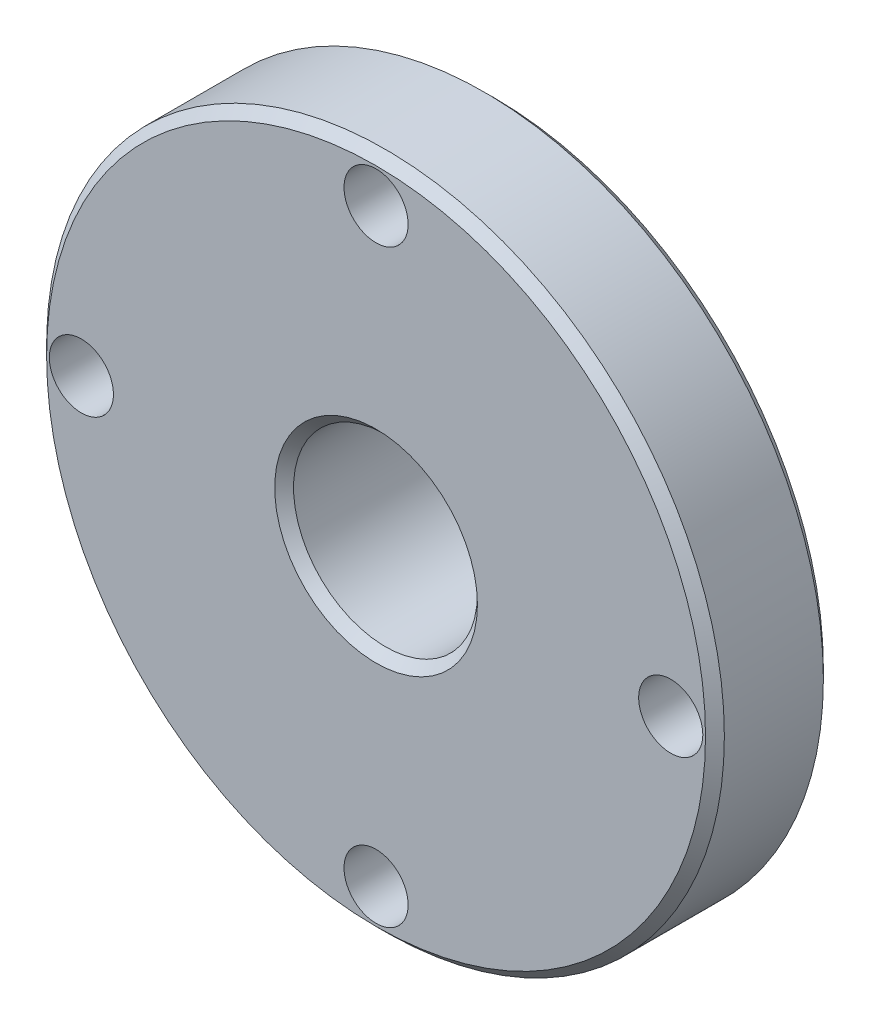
ISO-10303-21;
HEADER;
FILE_DESCRIPTION(('STEP AP214'),'2;1');
FILE_NAME('part.step','',(''),(''),'','','');
FILE_SCHEMA(('AUTOMOTIVE_DESIGN { 1 0 10303 214 1 1 1 1 }'));
ENDSEC;
DATA;
#1=APPLICATION_CONTEXT('core data for automotive mechanical design processes');
#2=APPLICATION_PROTOCOL_DEFINITION('international standard','automotive_design',2000,#1);
#3=PRODUCT_CONTEXT('',#1,'mechanical');
#4=PRODUCT('Part','Part','',(#3));
#5=PRODUCT_RELATED_PRODUCT_CATEGORY('part','',(#4));
#6=PRODUCT_DEFINITION_FORMATION('','',#4);
#7=PRODUCT_DEFINITION_CONTEXT('part definition',#1,'design');
#8=PRODUCT_DEFINITION('design','',#6,#7);
#9=PRODUCT_DEFINITION_SHAPE('','',#8);
#10=(LENGTH_UNIT() NAMED_UNIT(*) SI_UNIT(.MILLI.,.METRE.));
#11=(NAMED_UNIT(*) PLANE_ANGLE_UNIT() SI_UNIT($,.RADIAN.));
#12=(NAMED_UNIT(*) SI_UNIT($,.STERADIAN.) SOLID_ANGLE_UNIT());
#13=UNCERTAINTY_MEASURE_WITH_UNIT(LENGTH_MEASURE(1.E-05),#10,'distance_accuracy_value','');
#14=(GEOMETRIC_REPRESENTATION_CONTEXT(3) GLOBAL_UNCERTAINTY_ASSIGNED_CONTEXT((#13)) GLOBAL_UNIT_ASSIGNED_CONTEXT((#10,
#11,#12)) REPRESENTATION_CONTEXT('',''));
#15=CARTESIAN_POINT('',(0.,0.,0.));
#16=DIRECTION('',(0.,0.,1.));
#17=DIRECTION('',(1.,0.,0.));
#18=AXIS2_PLACEMENT_3D('',#15,#16,#17);
#19=CARTESIAN_POINT('',(0.,0.,0.));
#20=DIRECTION('',(0.,0.,1.));
#21=DIRECTION('',(1.,0.,0.));
#22=AXIS2_PLACEMENT_3D('',#19,#20,#21);
#23=PLANE('',#22);
#24=CARTESIAN_POINT('',(0.,0.,0.));
#25=DIRECTION('',(0.,0.,1.));
#26=DIRECTION('',(1.,0.,0.));
#27=AXIS2_PLACEMENT_3D('',#24,#25,#26);
#28=CIRCLE('',#27,17.74825);
#29=CARTESIAN_POINT('',(17.74825,0.,0.));
#30=VERTEX_POINT('',#29);
#31=EDGE_CURVE('E61',#30,#30,#28,.F.);
#32=ORIENTED_EDGE('',*,*,#31,.T.);
#33=EDGE_LOOP('',(#32));
#34=FACE_BOUND('',#33,.T.);
#35=CARTESIAN_POINT('',(0.,15.875,0.));
#36=DIRECTION('',(0.,0.,1.));
#37=DIRECTION('',(1.,0.,0.));
#38=AXIS2_PLACEMENT_3D('',#35,#36,#37);
#39=CIRCLE('',#38,1.7272);
#40=CARTESIAN_POINT('',(1.7272,15.875,0.));
#41=VERTEX_POINT('',#40);
#42=EDGE_CURVE('E73',#41,#41,#39,.T.);
#43=ORIENTED_EDGE('',*,*,#42,.T.);
#44=EDGE_LOOP('',(#43));
#45=FACE_BOUND('',#44,.T.);
#46=CARTESIAN_POINT('',(-15.875,0.,0.));
#47=DIRECTION('',(0.,0.,1.));
#48=DIRECTION('',(1.,0.,0.));
#49=AXIS2_PLACEMENT_3D('',#46,#47,#48);
#50=CIRCLE('',#49,1.7272);
#51=CARTESIAN_POINT('',(-14.1478,0.,0.));
#52=VERTEX_POINT('',#51);
#53=EDGE_CURVE('E79',#52,#52,#50,.T.);
#54=ORIENTED_EDGE('',*,*,#53,.T.);
#55=EDGE_LOOP('',(#54));
#56=FACE_BOUND('',#55,.T.);
#57=CARTESIAN_POINT('',(0.,-15.875,0.));
#58=DIRECTION('',(0.,0.,1.));
#59=DIRECTION('',(1.,0.,0.));
#60=AXIS2_PLACEMENT_3D('',#57,#58,#59);
#61=CIRCLE('',#60,1.7272);
#62=CARTESIAN_POINT('',(1.7272,-15.875,0.));
#63=VERTEX_POINT('',#62);
#64=EDGE_CURVE('E85',#63,#63,#61,.T.);
#65=ORIENTED_EDGE('',*,*,#64,.T.);
#66=EDGE_LOOP('',(#65));
#67=FACE_BOUND('',#66,.T.);
#68=CARTESIAN_POINT('',(15.875,0.,0.));
#69=DIRECTION('',(0.,0.,1.));
#70=DIRECTION('',(1.,0.,0.));
#71=AXIS2_PLACEMENT_3D('',#68,#69,#70);
#72=CIRCLE('',#71,1.7272);
#73=CARTESIAN_POINT('',(17.6022,0.,0.));
#74=VERTEX_POINT('',#73);
#75=EDGE_CURVE('E91',#74,#74,#72,.T.);
#76=ORIENTED_EDGE('',*,*,#75,.T.);
#77=EDGE_LOOP('',(#76));
#78=FACE_BOUND('',#77,.T.);
#79=CARTESIAN_POINT('',(0.,0.,0.));
#80=DIRECTION('',(0.,0.,1.));
#81=DIRECTION('',(1.,0.,0.));
#82=AXIS2_PLACEMENT_3D('',#79,#80,#81);
#83=CIRCLE('',#82,9.4615);
#84=CARTESIAN_POINT('',(9.4615,0.,0.));
#85=VERTEX_POINT('',#84);
#86=EDGE_CURVE('E70',#85,#85,#83,.F.);
#87=ORIENTED_EDGE('',*,*,#86,.F.);
#88=EDGE_LOOP('',(#87));
#89=FACE_BOUND('',#88,.T.);
#90=ADVANCED_FACE('F32',(#34,#45,#56,#67,#78,#89),#23,.F.);
#91=CARTESIAN_POINT('',(0.,0.,6.35));
#92=DIRECTION('',(0.,0.,-1.));
#93=DIRECTION('',(-1.,0.,0.));
#94=AXIS2_PLACEMENT_3D('',#91,#92,#93);
#95=CYLINDRICAL_SURFACE('',#94,18.25625);
#96=CARTESIAN_POINT('',(0.,0.,0.508000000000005));
#97=DIRECTION('',(0.,0.,1.));
#98=DIRECTION('',(1.,0.,0.));
#99=AXIS2_PLACEMENT_3D('',#96,#97,#98);
#100=CIRCLE('',#99,18.25625);
#101=CARTESIAN_POINT('',(18.25625,0.,0.508000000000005));
#102=VERTEX_POINT('',#101);
#103=EDGE_CURVE('E64',#102,#102,#100,.T.);
#104=ORIENTED_EDGE('',*,*,#103,.T.);
#105=EDGE_LOOP('',(#104));
#106=FACE_BOUND('',#105,.T.);
#107=CARTESIAN_POINT('',(0.,0.,5.842));
#108=DIRECTION('',(0.,0.,1.));
#109=DIRECTION('',(1.,0.,0.));
#110=AXIS2_PLACEMENT_3D('',#107,#108,#109);
#111=CIRCLE('',#110,18.25625);
#112=CARTESIAN_POINT('',(18.25625,0.,5.842));
#113=VERTEX_POINT('',#112);
#114=EDGE_CURVE('E67',#113,#113,#111,.F.);
#115=ORIENTED_EDGE('',*,*,#114,.T.);
#116=EDGE_LOOP('',(#115));
#117=FACE_BOUND('',#116,.T.);
#118=ADVANCED_FACE('F34',(#106,#117),#95,.T.);
#119=CARTESIAN_POINT('',(0.,0.,6.35));
#120=DIRECTION('',(0.,0.,1.));
#121=DIRECTION('',(1.,0.,0.));
#122=AXIS2_PLACEMENT_3D('',#119,#120,#121);
#123=PLANE('',#122);
#124=CARTESIAN_POINT('',(0.,0.,6.35));
#125=DIRECTION('',(0.,0.,1.));
#126=DIRECTION('',(1.,0.,0.));
#127=AXIS2_PLACEMENT_3D('',#124,#125,#126);
#128=CIRCLE('',#127,17.74825);
#129=CARTESIAN_POINT('',(17.74825,0.,6.35));
#130=VERTEX_POINT('',#129);
#131=EDGE_CURVE('E55',#130,#130,#128,.T.);
#132=ORIENTED_EDGE('',*,*,#131,.T.);
#133=EDGE_LOOP('',(#132));
#134=FACE_BOUND('',#133,.T.);
#135=CARTESIAN_POINT('',(0.,0.,6.35));
#136=DIRECTION('',(0.,0.,1.));
#137=DIRECTION('',(1.,0.,0.));
#138=AXIS2_PLACEMENT_3D('',#135,#136,#137);
#139=CIRCLE('',#138,5.461);
#140=CARTESIAN_POINT('',(5.461,0.,6.35));
#141=VERTEX_POINT('',#140);
#142=EDGE_CURVE('E58',#141,#141,#139,.F.);
#143=ORIENTED_EDGE('',*,*,#142,.T.);
#144=EDGE_LOOP('',(#143));
#145=FACE_BOUND('',#144,.T.);
#146=CARTESIAN_POINT('',(15.875,0.,6.35));
#147=DIRECTION('',(0.,0.,1.));
#148=DIRECTION('',(1.,0.,0.));
#149=AXIS2_PLACEMENT_3D('',#146,#147,#148);
#150=CIRCLE('',#149,1.7272);
#151=CARTESIAN_POINT('',(17.6022,0.,6.35));
#152=VERTEX_POINT('',#151);
#153=EDGE_CURVE('E94',#152,#152,#150,.T.);
#154=ORIENTED_EDGE('',*,*,#153,.F.);
#155=EDGE_LOOP('',(#154));
#156=FACE_BOUND('',#155,.T.);
#157=CARTESIAN_POINT('',(0.,-15.875,6.35));
#158=DIRECTION('',(0.,0.,1.));
#159=DIRECTION('',(1.,0.,0.));
#160=AXIS2_PLACEMENT_3D('',#157,#158,#159);
#161=CIRCLE('',#160,1.7272);
#162=CARTESIAN_POINT('',(1.7272,-15.875,6.35));
#163=VERTEX_POINT('',#162);
#164=EDGE_CURVE('E88',#163,#163,#161,.T.);
#165=ORIENTED_EDGE('',*,*,#164,.F.);
#166=EDGE_LOOP('',(#165));
#167=FACE_BOUND('',#166,.T.);
#168=CARTESIAN_POINT('',(-15.875,0.,6.35));
#169=DIRECTION('',(0.,0.,1.));
#170=DIRECTION('',(1.,0.,0.));
#171=AXIS2_PLACEMENT_3D('',#168,#169,#170);
#172=CIRCLE('',#171,1.7272);
#173=CARTESIAN_POINT('',(-14.1478,0.,6.35));
#174=VERTEX_POINT('',#173);
#175=EDGE_CURVE('E82',#174,#174,#172,.T.);
#176=ORIENTED_EDGE('',*,*,#175,.F.);
#177=EDGE_LOOP('',(#176));
#178=FACE_BOUND('',#177,.T.);
#179=CARTESIAN_POINT('',(0.,15.875,6.35));
#180=DIRECTION('',(0.,0.,1.));
#181=DIRECTION('',(1.,0.,0.));
#182=AXIS2_PLACEMENT_3D('',#179,#180,#181);
#183=CIRCLE('',#182,1.7272);
#184=CARTESIAN_POINT('',(1.7272,15.875,6.35));
#185=VERTEX_POINT('',#184);
#186=EDGE_CURVE('E76',#185,#185,#183,.T.);
#187=ORIENTED_EDGE('',*,*,#186,.F.);
#188=EDGE_LOOP('',(#187));
#189=FACE_BOUND('',#188,.T.);
#190=ADVANCED_FACE('F100',(#134,#145,#156,#167,#178,#189),#123,.T.);
#191=CARTESIAN_POINT('',(0.,15.875,0.));
#192=DIRECTION('',(0.,0.,1.));
#193=DIRECTION('',(1.,0.,0.));
#194=AXIS2_PLACEMENT_3D('',#191,#192,#193);
#195=CYLINDRICAL_SURFACE('',#194,1.7272);
#196=ORIENTED_EDGE('',*,*,#42,.F.);
#197=EDGE_LOOP('',(#196));
#198=FACE_BOUND('',#197,.T.);
#199=ORIENTED_EDGE('',*,*,#186,.T.);
#200=EDGE_LOOP('',(#199));
#201=FACE_BOUND('',#200,.T.);
#202=ADVANCED_FACE('F103',(#198,#201),#195,.F.);
#203=CARTESIAN_POINT('',(-15.875,0.,0.));
#204=DIRECTION('',(0.,0.,1.));
#205=DIRECTION('',(1.,0.,0.));
#206=AXIS2_PLACEMENT_3D('',#203,#204,#205);
#207=CYLINDRICAL_SURFACE('',#206,1.7272);
#208=ORIENTED_EDGE('',*,*,#53,.F.);
#209=EDGE_LOOP('',(#208));
#210=FACE_BOUND('',#209,.T.);
#211=ORIENTED_EDGE('',*,*,#175,.T.);
#212=EDGE_LOOP('',(#211));
#213=FACE_BOUND('',#212,.T.);
#214=ADVANCED_FACE('F112',(#210,#213),#207,.F.);
#215=CARTESIAN_POINT('',(0.,-15.875,0.));
#216=DIRECTION('',(0.,0.,1.));
#217=DIRECTION('',(1.,0.,0.));
#218=AXIS2_PLACEMENT_3D('',#215,#216,#217);
#219=CYLINDRICAL_SURFACE('',#218,1.7272);
#220=ORIENTED_EDGE('',*,*,#64,.F.);
#221=EDGE_LOOP('',(#220));
#222=FACE_BOUND('',#221,.T.);
#223=ORIENTED_EDGE('',*,*,#164,.T.);
#224=EDGE_LOOP('',(#223));
#225=FACE_BOUND('',#224,.T.);
#226=ADVANCED_FACE('F118',(#222,#225),#219,.F.);
#227=CARTESIAN_POINT('',(15.875,0.,0.));
#228=DIRECTION('',(0.,0.,1.));
#229=DIRECTION('',(1.,0.,0.));
#230=AXIS2_PLACEMENT_3D('',#227,#228,#229);
#231=CYLINDRICAL_SURFACE('',#230,1.7272);
#232=ORIENTED_EDGE('',*,*,#75,.F.);
#233=EDGE_LOOP('',(#232));
#234=FACE_BOUND('',#233,.T.);
#235=ORIENTED_EDGE('',*,*,#153,.T.);
#236=EDGE_LOOP('',(#235));
#237=FACE_BOUND('',#236,.T.);
#238=ADVANCED_FACE('F98',(#234,#237),#231,.F.);
#239=CARTESIAN_POINT('',(0.,0.,0.));
#240=DIRECTION('',(0.,0.,1.));
#241=DIRECTION('',(1.,0.,0.));
#242=AXIS2_PLACEMENT_3D('',#239,#240,#241);
#243=CYLINDRICAL_SURFACE('',#242,4.953);
#244=CARTESIAN_POINT('',(0.,0.,-1.524));
#245=DIRECTION('',(0.,0.,-1.));
#246=DIRECTION('',(-1.,0.,0.));
#247=AXIS2_PLACEMENT_3D('',#244,#245,#246);
#248=CIRCLE('',#247,4.953);
#249=CARTESIAN_POINT('',(-4.953,0.,-1.524));
#250=VERTEX_POINT('',#249);
#251=EDGE_CURVE('E47',#250,#250,#248,.T.);
#252=ORIENTED_EDGE('',*,*,#251,.T.);
#253=EDGE_LOOP('',(#252));
#254=FACE_BOUND('',#253,.T.);
#255=CARTESIAN_POINT('',(0.,0.,5.842));
#256=DIRECTION('',(0.,0.,1.));
#257=DIRECTION('',(1.,0.,0.));
#258=AXIS2_PLACEMENT_3D('',#255,#256,#257);
#259=CIRCLE('',#258,4.953);
#260=CARTESIAN_POINT('',(4.953,0.,5.842));
#261=VERTEX_POINT('',#260);
#262=EDGE_CURVE('E52',#261,#261,#259,.T.);
#263=ORIENTED_EDGE('',*,*,#262,.T.);
#264=EDGE_LOOP('',(#263));
#265=FACE_BOUND('',#264,.T.);
#266=ADVANCED_FACE('F152',(#254,#265),#243,.F.);
#267=CARTESIAN_POINT('',(0.,0.,-2.032));
#268=DIRECTION('',(0.,0.,-1.));
#269=DIRECTION('',(-1.,0.,0.));
#270=AXIS2_PLACEMENT_3D('',#267,#268,#269);
#271=PLANE('',#270);
#272=CARTESIAN_POINT('',(0.,0.,-2.032));
#273=DIRECTION('',(0.,0.,-1.));
#274=DIRECTION('',(-1.,0.,0.));
#275=AXIS2_PLACEMENT_3D('',#272,#273,#274);
#276=CIRCLE('',#275,5.461);
#277=CARTESIAN_POINT('',(-5.461,0.,-2.032));
#278=VERTEX_POINT('',#277);
#279=EDGE_CURVE('E39',#278,#278,#276,.F.);
#280=ORIENTED_EDGE('',*,*,#279,.T.);
#281=EDGE_LOOP('',(#280));
#282=FACE_BOUND('',#281,.T.);
#283=CARTESIAN_POINT('',(0.,0.,-2.032));
#284=DIRECTION('',(0.,0.,-1.));
#285=DIRECTION('',(-1.,0.,0.));
#286=AXIS2_PLACEMENT_3D('',#283,#284,#285);
#287=CIRCLE('',#286,8.9535);
#288=CARTESIAN_POINT('',(-8.9535,0.,-2.032));
#289=VERTEX_POINT('',#288);
#290=EDGE_CURVE('E43',#289,#289,#287,.T.);
#291=ORIENTED_EDGE('',*,*,#290,.T.);
#292=EDGE_LOOP('',(#291));
#293=FACE_BOUND('',#292,.T.);
#294=ADVANCED_FACE('F143',(#282,#293),#271,.T.);
#295=CARTESIAN_POINT('',(0.,0.,-2.032));
#296=DIRECTION('',(0.,0.,1.));
#297=DIRECTION('',(1.,0.,0.));
#298=AXIS2_PLACEMENT_3D('',#295,#296,#297);
#299=CYLINDRICAL_SURFACE('',#298,9.4615);
#300=CARTESIAN_POINT('',(0.,0.,-1.524));
#301=DIRECTION('',(0.,0.,-1.));
#302=DIRECTION('',(-1.,0.,0.));
#303=AXIS2_PLACEMENT_3D('',#300,#301,#302);
#304=CIRCLE('',#303,9.4615);
#305=CARTESIAN_POINT('',(-9.4615,0.,-1.524));
#306=VERTEX_POINT('',#305);
#307=EDGE_CURVE('E10',#306,#306,#304,.F.);
#308=ORIENTED_EDGE('',*,*,#307,.T.);
#309=EDGE_LOOP('',(#308));
#310=FACE_BOUND('',#309,.T.);
#311=ORIENTED_EDGE('',*,*,#86,.T.);
#312=EDGE_LOOP('',(#311));
#313=FACE_BOUND('',#312,.T.);
#314=ADVANCED_FACE('F140',(#310,#313),#299,.T.);
#315=CARTESIAN_POINT('',(0.,0.,0.508000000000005));
#316=DIRECTION('',(0.,0.,1.));
#317=DIRECTION('',(1.,0.,0.));
#318=AXIS2_PLACEMENT_3D('',#315,#316,#317);
#319=CONICAL_SURFACE('',#318,18.25625,0.785398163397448);
#320=ORIENTED_EDGE('',*,*,#31,.F.);
#321=EDGE_LOOP('',(#320));
#322=FACE_BOUND('',#321,.T.);
#323=ORIENTED_EDGE('',*,*,#103,.F.);
#324=EDGE_LOOP('',(#323));
#325=FACE_BOUND('',#324,.T.);
#326=ADVANCED_FACE('F142',(#322,#325),#319,.T.);
#327=CARTESIAN_POINT('',(0.,0.,6.35));
#328=DIRECTION('',(0.,0.,-1.));
#329=DIRECTION('',(-1.,0.,0.));
#330=AXIS2_PLACEMENT_3D('',#327,#328,#329);
#331=CONICAL_SURFACE('',#330,17.74825,0.785398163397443);
#332=ORIENTED_EDGE('',*,*,#114,.F.);
#333=EDGE_LOOP('',(#332));
#334=FACE_BOUND('',#333,.T.);
#335=ORIENTED_EDGE('',*,*,#131,.F.);
#336=EDGE_LOOP('',(#335));
#337=FACE_BOUND('',#336,.T.);
#338=ADVANCED_FACE('F149',(#334,#337),#331,.T.);
#339=CARTESIAN_POINT('',(0.,0.,-1.524));
#340=DIRECTION('',(0.,0.,-1.));
#341=DIRECTION('',(-1.,0.,0.));
#342=AXIS2_PLACEMENT_3D('',#339,#340,#341);
#343=CONICAL_SURFACE('',#342,4.953,0.785398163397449);
#344=ORIENTED_EDGE('',*,*,#279,.F.);
#345=EDGE_LOOP('',(#344));
#346=FACE_BOUND('',#345,.T.);
#347=ORIENTED_EDGE('',*,*,#251,.F.);
#348=EDGE_LOOP('',(#347));
#349=FACE_BOUND('',#348,.T.);
#350=ADVANCED_FACE('F200',(#346,#349),#343,.F.);
#351=CARTESIAN_POINT('',(0.,0.,-2.032));
#352=DIRECTION('',(0.,0.,1.));
#353=DIRECTION('',(1.,0.,0.));
#354=AXIS2_PLACEMENT_3D('',#351,#352,#353);
#355=CONICAL_SURFACE('',#354,8.9535,0.785398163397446);
#356=ORIENTED_EDGE('',*,*,#307,.F.);
#357=EDGE_LOOP('',(#356));
#358=FACE_BOUND('',#357,.T.);
#359=ORIENTED_EDGE('',*,*,#290,.F.);
#360=EDGE_LOOP('',(#359));
#361=FACE_BOUND('',#360,.T.);
#362=ADVANCED_FACE('F210',(#358,#361),#355,.T.);
#363=CARTESIAN_POINT('',(0.,0.,5.842));
#364=DIRECTION('',(0.,0.,1.));
#365=DIRECTION('',(1.,0.,0.));
#366=AXIS2_PLACEMENT_3D('',#363,#364,#365);
#367=CONICAL_SURFACE('',#366,4.953,0.78539816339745);
#368=ORIENTED_EDGE('',*,*,#142,.F.);
#369=EDGE_LOOP('',(#368));
#370=FACE_BOUND('',#369,.T.);
#371=ORIENTED_EDGE('',*,*,#262,.F.);
#372=EDGE_LOOP('',(#371));
#373=FACE_BOUND('',#372,.T.);
#374=ADVANCED_FACE('F220',(#370,#373),#367,.F.);
#375=CLOSED_SHELL('',(#90,#118,#190,#202,#214,#226,#238,#266,#294,#314,#326,#338,#350,#362,#374));
#376=MANIFOLD_SOLID_BREP('B2',#375);
#377=ADVANCED_BREP_SHAPE_REPRESENTATION('',(#18,#376),#14);
#378=SHAPE_DEFINITION_REPRESENTATION(#9,#377);
ENDSEC;
END-ISO-10303-21;
